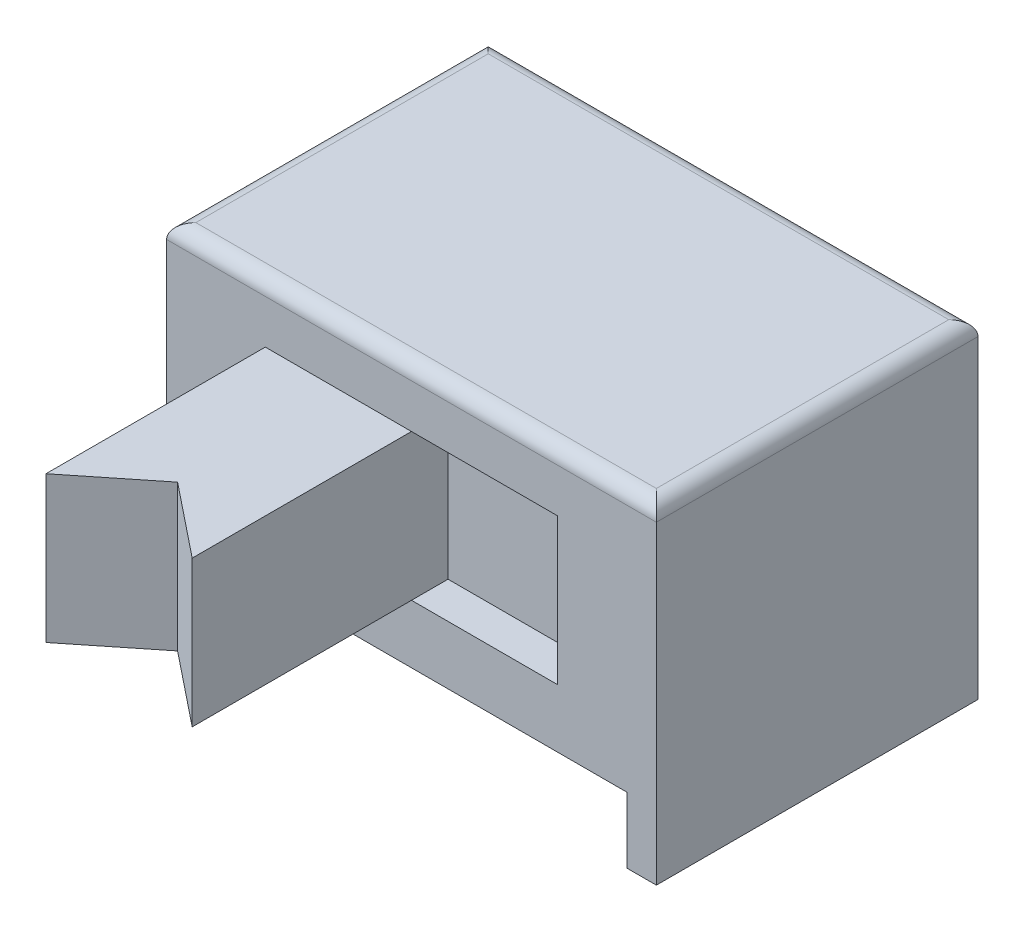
from build123d import *

# Parameters (mm, degrees)
ESQUISSE1_W             = 6.7
ESQUISSE1_H             = 4.4
EXTRUSION1_DEPTH        = 4.5
ESQUISSE2_W             = 4
ESQUISSE2_H             = 2
ENL_V_MAT_EXTRU_1_DEPTH = 0.5
ESQUISSE3_W             = 2
ESQUISSE3_H             = 2
EXTRUSION2_DEPTH        = 3.5
ENL_V_MAT_EXTRU_2_DEPTH = 9.490583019
CONG_2_R                = 0.2
ESQUISSE5_W             = 5.9
ESQUISSE5_H             = 0.9
ENL_V_MAT_EXTRU_3_DEPTH = 10.192388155


with BuildPart() as part:
    # Esquisse1 → Extrusion1 (new body)
    with BuildSketch(Plane(origin=(0, 0, 0), x_dir=(1, 0, 0), z_dir=(0, 1, 0))):
        with Locations((3.35, 2.2)):
            Rectangle(ESQUISSE1_W, ESQUISSE1_H)
    extrude(amount=EXTRUSION1_DEPTH)

    # Esquisse2 → Enl_v. mat.-Extru.1 (cut)
    with BuildSketch(Plane.XY):
        with Locations((3.35, 2.7)):
            Rectangle(ESQUISSE2_W, ESQUISSE2_H)
    extrude(amount=-ENL_V_MAT_EXTRU_1_DEPTH, mode=Mode.SUBTRACT)

    # Esquisse3 → Extrusion2 (add)
    with BuildSketch(Plane.XY.offset(-0.5)):
        with Locations((2.35, 2.7)):
            Rectangle(ESQUISSE3_W, ESQUISSE3_H)
    extrude(amount=EXTRUSION2_DEPTH)

    # Esquisse4 → Enl_v. mat.-Extru.2 (cut, through all)
    with BuildSketch(Plane.XZ.offset(-1.7)):
        Polygon((2.35, 2.2), (3.35, 3), (1.35, 3), align=None)
    extrude(amount=-ENL_V_MAT_EXTRU_2_DEPTH, mode=Mode.SUBTRACT)

    # Cong_2
    cong_2_edges = [part.edges().sort_by_distance(p)[0] for p in [
        (6.7, 4.5, -2.2),
        (3.35, 4.5, -4.4),
        (0, 4.5, -2.2),
        (3.35, 4.5, 0),
    ]]
    fillet(cong_2_edges, radius=CONG_2_R)

    # Esquisse5 → Enl_v. mat.-Extru.3 (cut, through all)
    with BuildSketch(Plane.XY):
        with Locations((3.35, 0.45)):
            Rectangle(ESQUISSE5_W, ESQUISSE5_H)
    extrude(amount=-ENL_V_MAT_EXTRU_3_DEPTH, mode=Mode.SUBTRACT)


solid = part.part
